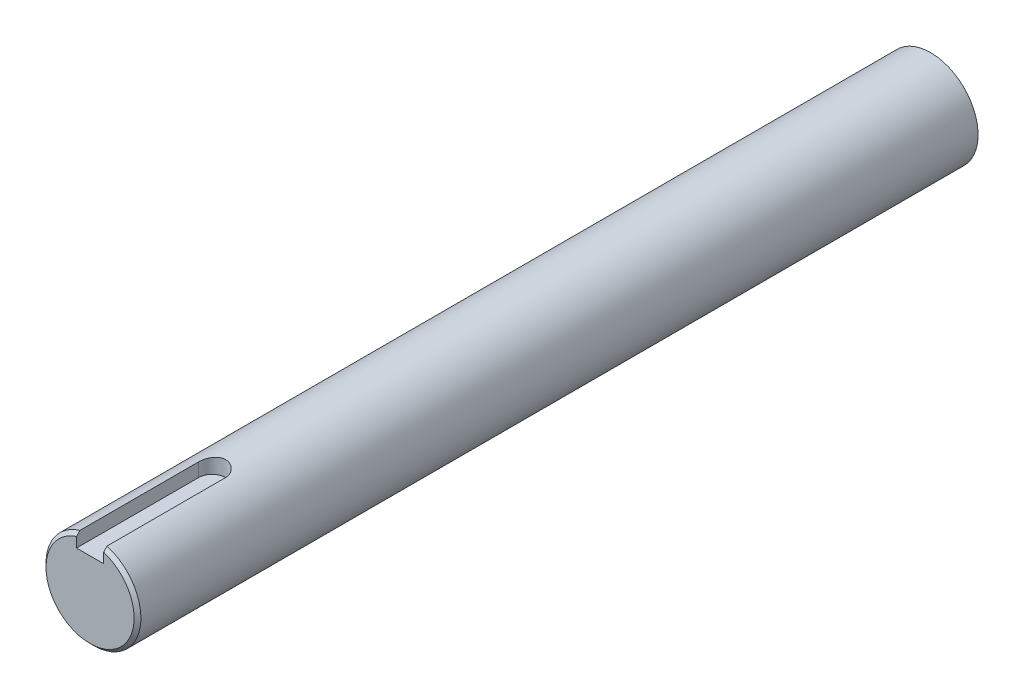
ISO-10303-21;
HEADER;
FILE_DESCRIPTION(('STEP AP214'),'2;1');
FILE_NAME('part.step','',(''),(''),'','','');
FILE_SCHEMA(('AUTOMOTIVE_DESIGN { 1 0 10303 214 1 1 1 1 }'));
ENDSEC;
DATA;
#1=APPLICATION_CONTEXT('core data for automotive mechanical design processes');
#2=APPLICATION_PROTOCOL_DEFINITION('international standard','automotive_design',2000,#1);
#3=PRODUCT_CONTEXT('',#1,'mechanical');
#4=PRODUCT('Part','Part','',(#3));
#5=PRODUCT_RELATED_PRODUCT_CATEGORY('part','',(#4));
#6=PRODUCT_DEFINITION_FORMATION('','',#4);
#7=PRODUCT_DEFINITION_CONTEXT('part definition',#1,'design');
#8=PRODUCT_DEFINITION('design','',#6,#7);
#9=PRODUCT_DEFINITION_SHAPE('','',#8);
#10=(LENGTH_UNIT() NAMED_UNIT(*) SI_UNIT(.MILLI.,.METRE.));
#11=(NAMED_UNIT(*) PLANE_ANGLE_UNIT() SI_UNIT($,.RADIAN.));
#12=(NAMED_UNIT(*) SI_UNIT($,.STERADIAN.) SOLID_ANGLE_UNIT());
#13=UNCERTAINTY_MEASURE_WITH_UNIT(LENGTH_MEASURE(1.E-05),#10,'distance_accuracy_value','');
#14=(GEOMETRIC_REPRESENTATION_CONTEXT(3) GLOBAL_UNCERTAINTY_ASSIGNED_CONTEXT((#13)) GLOBAL_UNIT_ASSIGNED_CONTEXT((#10,
#11,#12)) REPRESENTATION_CONTEXT('',''));
#15=CARTESIAN_POINT('',(0.,0.,0.));
#16=DIRECTION('',(0.,0.,1.));
#17=DIRECTION('',(1.,0.,0.));
#18=AXIS2_PLACEMENT_3D('',#15,#16,#17);
#19=CARTESIAN_POINT('',(0.,0.,98.));
#20=DIRECTION('',(0.,0.,-1.));
#21=DIRECTION('',(-1.,0.,0.));
#22=AXIS2_PLACEMENT_3D('',#19,#20,#21);
#23=CYLINDRICAL_SURFACE('',#22,7.);
#24=DIRECTION('',(0.,0.,-1.));
#25=VECTOR('',#24,1.);
#26=CARTESIAN_POINT('',(2.,6.70820393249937,98.));
#27=LINE('',#26,#25);
#28=CARTESIAN_POINT('',(2.,6.70820393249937,97.5));
#29=VERTEX_POINT('',#28);
#30=CARTESIAN_POINT('',(2.,6.70820393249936,80.));
#31=VERTEX_POINT('',#30);
#32=EDGE_CURVE('E103',#29,#31,#27,.T.);
#33=ORIENTED_EDGE('',*,*,#32,.F.);
#34=CARTESIAN_POINT('',(0.,0.,97.5));
#35=DIRECTION('',(0.,0.,1.));
#36=DIRECTION('',(1.,0.,0.));
#37=AXIS2_PLACEMENT_3D('',#34,#35,#36);
#38=CIRCLE('',#37,7.);
#39=CARTESIAN_POINT('',(-2.,6.70820393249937,97.5));
#40=VERTEX_POINT('',#39);
#41=EDGE_CURVE('E48',#29,#40,#38,.F.);
#42=ORIENTED_EDGE('',*,*,#41,.T.);
#43=DIRECTION('',(0.,0.,-1.));
#44=VECTOR('',#43,1.);
#45=CARTESIAN_POINT('',(-2.,6.70820393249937,98.));
#46=LINE('',#45,#44);
#47=CARTESIAN_POINT('',(-2.,6.70820393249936,80.));
#48=VERTEX_POINT('',#47);
#49=EDGE_CURVE('E114',#40,#48,#46,.T.);
#50=ORIENTED_EDGE('',*,*,#49,.T.);
#51=CARTESIAN_POINT('',(2.,6.70820393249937,80.));
#52=CARTESIAN_POINT('',(2.00000099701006,6.70819953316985,79.9449659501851));
#53=CARTESIAN_POINT('',(1.99772698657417,6.70888204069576,79.8899594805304));
#54=CARTESIAN_POINT('',(1.988664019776,6.71157572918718,79.7803637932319));
#55=CARTESIAN_POINT('',(1.98187599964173,6.71358663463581,79.7257744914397));
#56=CARTESIAN_POINT('',(1.95485062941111,6.72152750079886,79.563492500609));
#57=CARTESIAN_POINT('',(1.92795143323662,6.72936619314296,79.4569243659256));
#58=CARTESIAN_POINT('',(1.85729763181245,6.74920530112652,79.2500599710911));
#59=CARTESIAN_POINT('',(1.81354760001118,6.76120458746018,79.1497620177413));
#60=CARTESIAN_POINT('',(1.7105009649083,6.78800504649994,78.9578633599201));
#61=CARTESIAN_POINT('',(1.65119805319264,6.80280735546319,78.8662662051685));
#62=CARTESIAN_POINT('',(1.51692637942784,6.83401742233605,78.6918092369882));
#63=CARTESIAN_POINT('',(1.44159286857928,6.85045675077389,78.6092358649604));
#64=CARTESIAN_POINT('',(1.27817556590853,6.88281888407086,78.4577009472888));
#65=CARTESIAN_POINT('',(1.19008966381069,6.89874160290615,78.3887416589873));
#66=CARTESIAN_POINT('',(1.00164390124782,6.92863365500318,78.2651698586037));
#67=CARTESIAN_POINT('',(0.901086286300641,6.94256116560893,78.210847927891));
#68=CARTESIAN_POINT('',(0.69180361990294,6.96652585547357,78.1199966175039));
#69=CARTESIAN_POINT('',(0.583080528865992,6.9765639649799,78.0834629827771));
#70=CARTESIAN_POINT('',(0.363559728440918,6.99139511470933,78.0301658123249));
#71=CARTESIAN_POINT('',(0.252890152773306,6.9963181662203,78.0129113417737));
#72=CARTESIAN_POINT('',(0.0301224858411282,7.0008209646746,77.9971132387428));
#73=CARTESIAN_POINT('',(-0.0819753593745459,7.00040161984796,77.9985664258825));
#74=CARTESIAN_POINT('',(-0.300980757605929,6.99436005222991,78.0198064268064));
#75=CARTESIAN_POINT('',(-0.40794465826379,6.98888865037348,78.0390618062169));
#76=CARTESIAN_POINT('',(-0.617053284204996,6.97353876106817,78.0944954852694));
#77=CARTESIAN_POINT('',(-0.719197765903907,6.96366005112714,78.1306746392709));
#78=CARTESIAN_POINT('',(-0.917074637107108,6.94039022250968,78.2193097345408));
#79=CARTESIAN_POINT('',(-1.01272458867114,6.92696183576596,78.2719395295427));
#80=CARTESIAN_POINT('',(-1.19400864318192,6.89802743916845,78.3918457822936));
#81=CARTESIAN_POINT('',(-1.27964070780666,6.88252100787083,78.4591252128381));
#82=CARTESIAN_POINT('',(-1.4416242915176,6.85045847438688,78.6091975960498));
#83=CARTESIAN_POINT('',(-1.51754611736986,6.83388462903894,78.6924510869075));
#84=CARTESIAN_POINT('',(-1.65448071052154,6.8020328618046,78.8706972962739));
#85=CARTESIAN_POINT('',(-1.71548924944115,6.78675530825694,78.9656933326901));
#86=CARTESIAN_POINT('',(-1.82126577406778,6.75914312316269,79.165787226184));
#87=CARTESIAN_POINT('',(-1.86589126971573,6.74683461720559,79.2709641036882));
#88=CARTESIAN_POINT('',(-1.93662306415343,6.72687625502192,79.4877120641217));
#89=CARTESIAN_POINT('',(-1.96275743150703,6.71921934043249,79.5992731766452));
#90=CARTESIAN_POINT('',(-1.98612021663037,6.71232934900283,79.7598794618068));
#91=CARTESIAN_POINT('',(-1.99132502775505,6.71078540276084,79.807779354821));
#92=CARTESIAN_POINT('',(-1.99826154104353,6.7087227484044,79.9037782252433));
#93=CARTESIAN_POINT('',(-1.99999854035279,6.70820247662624,79.9518767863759));
#94=CARTESIAN_POINT('',(-2.,6.70820393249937,80.));
#95=B_SPLINE_CURVE_WITH_KNOTS('',3,(#51,#52,#53,#54,#55,#56,#57,#58,#59,#60,#61,#62,#63,#64,#65,
#66,#67,#68,#69,#70,#71,#72,#73,#74,#75,#76,#77,#78,#79,#80,#81,#82,#83,#84,#85,#86,#87,#88,#89,
#90,#91,#92,#93,#94),.UNSPECIFIED.,.F.,.F.,(4,2,2,2,2,2,2,2,2,2,2,2,2,2,2,2,2,2,2,2,2,4),(0.,
0.164996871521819,0.32995953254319,0.658815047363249,0.987581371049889,1.3164812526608,
1.65386790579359,1.99131045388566,2.33502692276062,2.67866113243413,3.01332990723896,
3.34794178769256,3.67287650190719,3.99782762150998,4.32633613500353,4.65491137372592,
4.99498620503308,5.33515734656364,5.67822068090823,6.0207621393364,6.16526974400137,
6.30955644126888),.UNSPECIFIED.);
#96=EDGE_CURVE('E97',#31,#48,#95,.T.);
#97=ORIENTED_EDGE('',*,*,#96,.F.);
#98=EDGE_LOOP('',(#33,#42,#50,#97));
#99=FACE_BOUND('',#98,.T.);
#100=CARTESIAN_POINT('',(0.,0.,-26.));
#101=DIRECTION('',(0.,0.,-1.));
#102=DIRECTION('',(-1.,0.,0.));
#103=AXIS2_PLACEMENT_3D('',#100,#101,#102);
#104=CIRCLE('',#103,7.);
#105=CARTESIAN_POINT('',(-7.,0.,-26.));
#106=VERTEX_POINT('',#105);
#107=EDGE_CURVE('E98',#106,#106,#104,.T.);
#108=ORIENTED_EDGE('',*,*,#107,.F.);
#109=EDGE_LOOP('',(#108));
#110=FACE_BOUND('',#109,.T.);
#111=ADVANCED_FACE('F35',(#99,#110),#23,.T.);
#112=CARTESIAN_POINT('',(2.,4.7,98.));
#113=DIRECTION('',(1.,0.,0.));
#114=DIRECTION('',(0.,1.,0.));
#115=AXIS2_PLACEMENT_3D('',#112,#113,#114);
#116=PLANE('',#115);
#117=DIRECTION('',(0.,-1.,0.));
#118=VECTOR('',#117,1.);
#119=CARTESIAN_POINT('',(2.,4.7,98.));
#120=LINE('',#119,#118);
#121=CARTESIAN_POINT('',(2.,6.18465843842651,98.));
#122=VERTEX_POINT('',#121);
#123=CARTESIAN_POINT('',(2.,4.7,98.));
#124=VERTEX_POINT('',#123);
#125=EDGE_CURVE('E104',#122,#124,#120,.T.);
#126=ORIENTED_EDGE('',*,*,#125,.F.);
#127=CARTESIAN_POINT('',(2.,6.18465843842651,98.));
#128=CARTESIAN_POINT('',(2.,6.27206463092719,97.9168222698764));
#129=CARTESIAN_POINT('',(2.,6.35939651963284,97.8335667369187));
#130=CARTESIAN_POINT('',(2.,6.53391168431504,97.6669000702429));
#131=CARTESIAN_POINT('',(2.,6.62109496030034,97.583488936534));
#132=CARTESIAN_POINT('',(2.,6.70820393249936,97.5));
#133=B_SPLINE_CURVE_WITH_KNOTS('',3,(#127,#128,#129,#130,#131,#132),.UNSPECIFIED.,.F.,.F.,(4,2,
4),(0.,0.361973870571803,0.723947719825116),.UNSPECIFIED.);
#134=EDGE_CURVE('E62',#122,#29,#133,.T.);
#135=ORIENTED_EDGE('',*,*,#134,.T.);
#136=ORIENTED_EDGE('',*,*,#32,.T.);
#137=DIRECTION('',(0.,1.,0.));
#138=VECTOR('',#137,1.);
#139=CARTESIAN_POINT('',(2.,4.7,80.));
#140=LINE('',#139,#138);
#141=CARTESIAN_POINT('',(2.,4.7,80.));
#142=VERTEX_POINT('',#141);
#143=EDGE_CURVE('E89',#142,#31,#140,.T.);
#144=ORIENTED_EDGE('',*,*,#143,.F.);
#145=DIRECTION('',(0.,0.,-1.));
#146=VECTOR('',#145,1.);
#147=CARTESIAN_POINT('',(2.,4.7,98.));
#148=LINE('',#147,#146);
#149=EDGE_CURVE('E102',#124,#142,#148,.T.);
#150=ORIENTED_EDGE('',*,*,#149,.F.);
#151=EDGE_LOOP('',(#126,#135,#136,#144,#150));
#152=FACE_BOUND('',#151,.T.);
#153=ADVANCED_FACE('F101',(#152),#116,.F.);
#154=CARTESIAN_POINT('',(2.,4.7,98.));
#155=DIRECTION('',(0.,-1.,0.));
#156=DIRECTION('',(1.,0.,0.));
#157=AXIS2_PLACEMENT_3D('',#154,#155,#156);
#158=PLANE('',#157);
#159=ORIENTED_EDGE('',*,*,#149,.T.);
#160=CARTESIAN_POINT('',(0.,4.7,80.));
#161=DIRECTION('',(0.,1.,0.));
#162=DIRECTION('',(-1.,0.,0.));
#163=AXIS2_PLACEMENT_3D('',#160,#161,#162);
#164=CIRCLE('',#163,2.);
#165=CARTESIAN_POINT('',(-2.,4.7,80.));
#166=VERTEX_POINT('',#165);
#167=EDGE_CURVE('E85',#142,#166,#164,.T.);
#168=ORIENTED_EDGE('',*,*,#167,.T.);
#169=DIRECTION('',(0.,0.,-1.));
#170=VECTOR('',#169,1.);
#171=CARTESIAN_POINT('',(-2.,4.7,98.));
#172=LINE('',#171,#170);
#173=CARTESIAN_POINT('',(-2.,4.7,98.));
#174=VERTEX_POINT('',#173);
#175=EDGE_CURVE('E110',#174,#166,#172,.T.);
#176=ORIENTED_EDGE('',*,*,#175,.F.);
#177=DIRECTION('',(-1.,0.,0.));
#178=VECTOR('',#177,1.);
#179=CARTESIAN_POINT('',(2.,4.7,98.));
#180=LINE('',#179,#178);
#181=EDGE_CURVE('E108',#124,#174,#180,.T.);
#182=ORIENTED_EDGE('',*,*,#181,.F.);
#183=EDGE_LOOP('',(#159,#168,#176,#182));
#184=FACE_BOUND('',#183,.T.);
#185=ADVANCED_FACE('F107',(#184),#158,.F.);
#186=CARTESIAN_POINT('',(-2.,4.7,98.));
#187=DIRECTION('',(-1.,0.,0.));
#188=DIRECTION('',(0.,0.,1.));
#189=AXIS2_PLACEMENT_3D('',#186,#187,#188);
#190=PLANE('',#189);
#191=ORIENTED_EDGE('',*,*,#49,.F.);
#192=CARTESIAN_POINT('',(-2.,6.70820393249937,97.5));
#193=CARTESIAN_POINT('',(-2.,6.62109496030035,97.583488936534));
#194=CARTESIAN_POINT('',(-2.,6.53391168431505,97.6669000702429));
#195=CARTESIAN_POINT('',(-2.,6.35939651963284,97.8335667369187));
#196=CARTESIAN_POINT('',(-2.,6.27206463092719,97.9168222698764));
#197=CARTESIAN_POINT('',(-2.,6.18465843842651,98.));
#198=B_SPLINE_CURVE_WITH_KNOTS('',3,(#192,#193,#194,#195,#196,#197),.UNSPECIFIED.,.F.,.F.,(4,2,
4),(0.,0.361973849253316,0.723947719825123),.UNSPECIFIED.);
#199=CARTESIAN_POINT('',(-2.,6.18465843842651,98.));
#200=VERTEX_POINT('',#199);
#201=EDGE_CURVE('E11',#40,#200,#198,.T.);
#202=ORIENTED_EDGE('',*,*,#201,.T.);
#203=DIRECTION('',(0.,1.,0.));
#204=VECTOR('',#203,1.);
#205=CARTESIAN_POINT('',(-2.,4.7,98.));
#206=LINE('',#205,#204);
#207=EDGE_CURVE('E160',#174,#200,#206,.T.);
#208=ORIENTED_EDGE('',*,*,#207,.F.);
#209=ORIENTED_EDGE('',*,*,#175,.T.);
#210=DIRECTION('',(0.,-1.,0.));
#211=VECTOR('',#210,1.);
#212=CARTESIAN_POINT('',(-2.,4.7,80.));
#213=LINE('',#212,#211);
#214=EDGE_CURVE('E92',#48,#166,#213,.T.);
#215=ORIENTED_EDGE('',*,*,#214,.F.);
#216=EDGE_LOOP('',(#191,#202,#208,#209,#215));
#217=FACE_BOUND('',#216,.T.);
#218=ADVANCED_FACE('F125',(#217),#190,.F.);
#219=CARTESIAN_POINT('',(0.,0.,98.));
#220=DIRECTION('',(0.,0.,1.));
#221=DIRECTION('',(1.,0.,0.));
#222=AXIS2_PLACEMENT_3D('',#219,#220,#221);
#223=PLANE('',#222);
#224=ORIENTED_EDGE('',*,*,#207,.T.);
#225=CARTESIAN_POINT('',(0.,0.,98.));
#226=DIRECTION('',(0.,0.,1.));
#227=DIRECTION('',(1.,0.,0.));
#228=AXIS2_PLACEMENT_3D('',#225,#226,#227);
#229=CIRCLE('',#228,6.50000000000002);
#230=EDGE_CURVE('E109',#200,#122,#229,.T.);
#231=ORIENTED_EDGE('',*,*,#230,.T.);
#232=ORIENTED_EDGE('',*,*,#125,.T.);
#233=ORIENTED_EDGE('',*,*,#181,.T.);
#234=EDGE_LOOP('',(#224,#231,#232,#233));
#235=FACE_BOUND('',#234,.T.);
#236=ADVANCED_FACE('F129',(#235),#223,.T.);
#237=CARTESIAN_POINT('',(0.,84.7,80.));
#238=DIRECTION('',(0.,-1.,0.));
#239=DIRECTION('',(1.,0.,0.));
#240=AXIS2_PLACEMENT_3D('',#237,#238,#239);
#241=CYLINDRICAL_SURFACE('',#240,2.);
#242=ORIENTED_EDGE('',*,*,#96,.T.);
#243=ORIENTED_EDGE('',*,*,#214,.T.);
#244=ORIENTED_EDGE('',*,*,#167,.F.);
#245=ORIENTED_EDGE('',*,*,#143,.T.);
#246=EDGE_LOOP('',(#242,#243,#244,#245));
#247=FACE_BOUND('',#246,.T.);
#248=ADVANCED_FACE('F88',(#247),#241,.F.);
#249=CARTESIAN_POINT('',(0.,0.,98.));
#250=DIRECTION('',(0.,0.,-1.));
#251=DIRECTION('',(-1.,0.,0.));
#252=AXIS2_PLACEMENT_3D('',#249,#250,#251);
#253=CONICAL_SURFACE('',#252,6.50000000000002,0.785398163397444);
#254=ORIENTED_EDGE('',*,*,#201,.F.);
#255=ORIENTED_EDGE('',*,*,#41,.F.);
#256=ORIENTED_EDGE('',*,*,#134,.F.);
#257=ORIENTED_EDGE('',*,*,#230,.F.);
#258=EDGE_LOOP('',(#254,#255,#256,#257));
#259=FACE_BOUND('',#258,.T.);
#260=ADVANCED_FACE('F37',(#259),#253,.T.);
#261=CARTESIAN_POINT('',(0.,0.,-26.));
#262=DIRECTION('',(0.,0.,-1.));
#263=DIRECTION('',(-1.,0.,0.));
#264=AXIS2_PLACEMENT_3D('',#261,#262,#263);
#265=PLANE('',#264);
#266=ORIENTED_EDGE('',*,*,#107,.T.);
#267=EDGE_LOOP('',(#266));
#268=FACE_BOUND('',#267,.T.);
#269=ADVANCED_FACE('F144',(#268),#265,.T.);
#270=CLOSED_SHELL('',(#111,#153,#185,#218,#236,#248,#260,#269));
#271=MANIFOLD_SOLID_BREP('B2',#270);
#272=ADVANCED_BREP_SHAPE_REPRESENTATION('',(#18,#271),#14);
#273=SHAPE_DEFINITION_REPRESENTATION(#9,#272);
ENDSEC;
END-ISO-10303-21;
